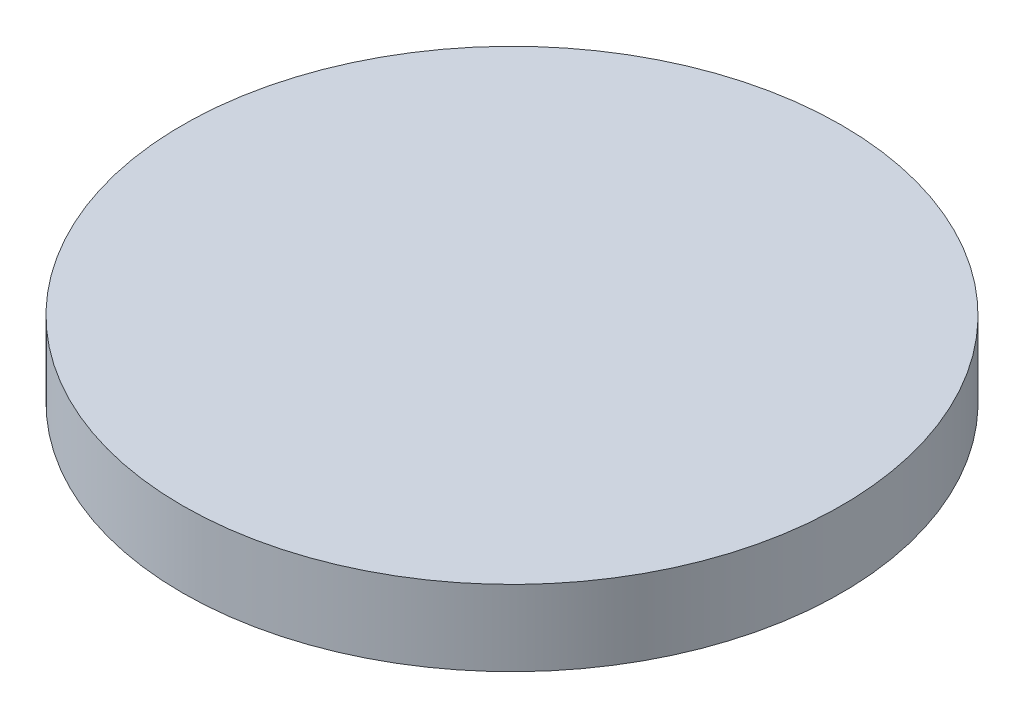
ISO-10303-21;
HEADER;
FILE_DESCRIPTION(('STEP AP214'),'2;1');
FILE_NAME('part.step','',(''),(''),'','','');
FILE_SCHEMA(('AUTOMOTIVE_DESIGN { 1 0 10303 214 1 1 1 1 }'));
ENDSEC;
DATA;
#1=APPLICATION_CONTEXT('core data for automotive mechanical design processes');
#2=APPLICATION_PROTOCOL_DEFINITION('international standard','automotive_design',2000,#1);
#3=PRODUCT_CONTEXT('',#1,'mechanical');
#4=PRODUCT('Part','Part','',(#3));
#5=PRODUCT_RELATED_PRODUCT_CATEGORY('part','',(#4));
#6=PRODUCT_DEFINITION_FORMATION('','',#4);
#7=PRODUCT_DEFINITION_CONTEXT('part definition',#1,'design');
#8=PRODUCT_DEFINITION('design','',#6,#7);
#9=PRODUCT_DEFINITION_SHAPE('','',#8);
#10=(LENGTH_UNIT() NAMED_UNIT(*) SI_UNIT(.MILLI.,.METRE.));
#11=(NAMED_UNIT(*) PLANE_ANGLE_UNIT() SI_UNIT($,.RADIAN.));
#12=(NAMED_UNIT(*) SI_UNIT($,.STERADIAN.) SOLID_ANGLE_UNIT());
#13=UNCERTAINTY_MEASURE_WITH_UNIT(LENGTH_MEASURE(1.E-05),#10,'distance_accuracy_value','');
#14=(GEOMETRIC_REPRESENTATION_CONTEXT(3) GLOBAL_UNCERTAINTY_ASSIGNED_CONTEXT((#13)) GLOBAL_UNIT_ASSIGNED_CONTEXT((#10,
#11,#12)) REPRESENTATION_CONTEXT('',''));
#15=CARTESIAN_POINT('',(0.,0.,0.));
#16=DIRECTION('',(0.,0.,1.));
#17=DIRECTION('',(1.,0.,0.));
#18=AXIS2_PLACEMENT_3D('',#15,#16,#17);
#19=CARTESIAN_POINT('',(0.,10.,0.));
#20=DIRECTION('',(0.,-1.,0.));
#21=DIRECTION('',(0.,0.,-1.));
#22=AXIS2_PLACEMENT_3D('',#19,#20,#21);
#23=CYLINDRICAL_SURFACE('',#22,87.2);
#24=CARTESIAN_POINT('',(0.,10.,0.));
#25=DIRECTION('',(0.,1.,0.));
#26=DIRECTION('',(0.,0.,1.));
#27=AXIS2_PLACEMENT_3D('',#24,#25,#26);
#28=CIRCLE('',#27,87.2);
#29=CARTESIAN_POINT('',(0.,10.,87.2));
#30=VERTEX_POINT('',#29);
#31=EDGE_CURVE('E10',#30,#30,#28,.T.);
#32=ORIENTED_EDGE('',*,*,#31,.F.);
#33=EDGE_LOOP('',(#32));
#34=FACE_BOUND('',#33,.T.);
#35=CARTESIAN_POINT('',(0.,-10.,0.));
#36=DIRECTION('',(0.,1.,0.));
#37=DIRECTION('',(0.,0.,1.));
#38=AXIS2_PLACEMENT_3D('',#35,#36,#37);
#39=CIRCLE('',#38,87.2);
#40=CARTESIAN_POINT('',(0.,-10.,87.2));
#41=VERTEX_POINT('',#40);
#42=EDGE_CURVE('E33',#41,#41,#39,.T.);
#43=ORIENTED_EDGE('',*,*,#42,.T.);
#44=EDGE_LOOP('',(#43));
#45=FACE_BOUND('',#44,.T.);
#46=ADVANCED_FACE('F30',(#34,#45),#23,.T.);
#47=CARTESIAN_POINT('',(0.,10.,0.));
#48=DIRECTION('',(0.,1.,0.));
#49=DIRECTION('',(0.,0.,1.));
#50=AXIS2_PLACEMENT_3D('',#47,#48,#49);
#51=PLANE('',#50);
#52=ORIENTED_EDGE('',*,*,#31,.T.);
#53=EDGE_LOOP('',(#52));
#54=FACE_BOUND('',#53,.T.);
#55=ADVANCED_FACE('F45',(#54),#51,.T.);
#56=CARTESIAN_POINT('',(0.,-10.,0.));
#57=DIRECTION('',(0.,1.,0.));
#58=DIRECTION('',(0.,0.,1.));
#59=AXIS2_PLACEMENT_3D('',#56,#57,#58);
#60=PLANE('',#59);
#61=ORIENTED_EDGE('',*,*,#42,.F.);
#62=EDGE_LOOP('',(#61));
#63=FACE_BOUND('',#62,.T.);
#64=ADVANCED_FACE('F43',(#63),#60,.F.);
#65=CLOSED_SHELL('',(#46,#55,#64));
#66=MANIFOLD_SOLID_BREP('B2',#65);
#67=ADVANCED_BREP_SHAPE_REPRESENTATION('',(#18,#66),#14);
#68=SHAPE_DEFINITION_REPRESENTATION(#9,#67);
ENDSEC;
END-ISO-10303-21;
